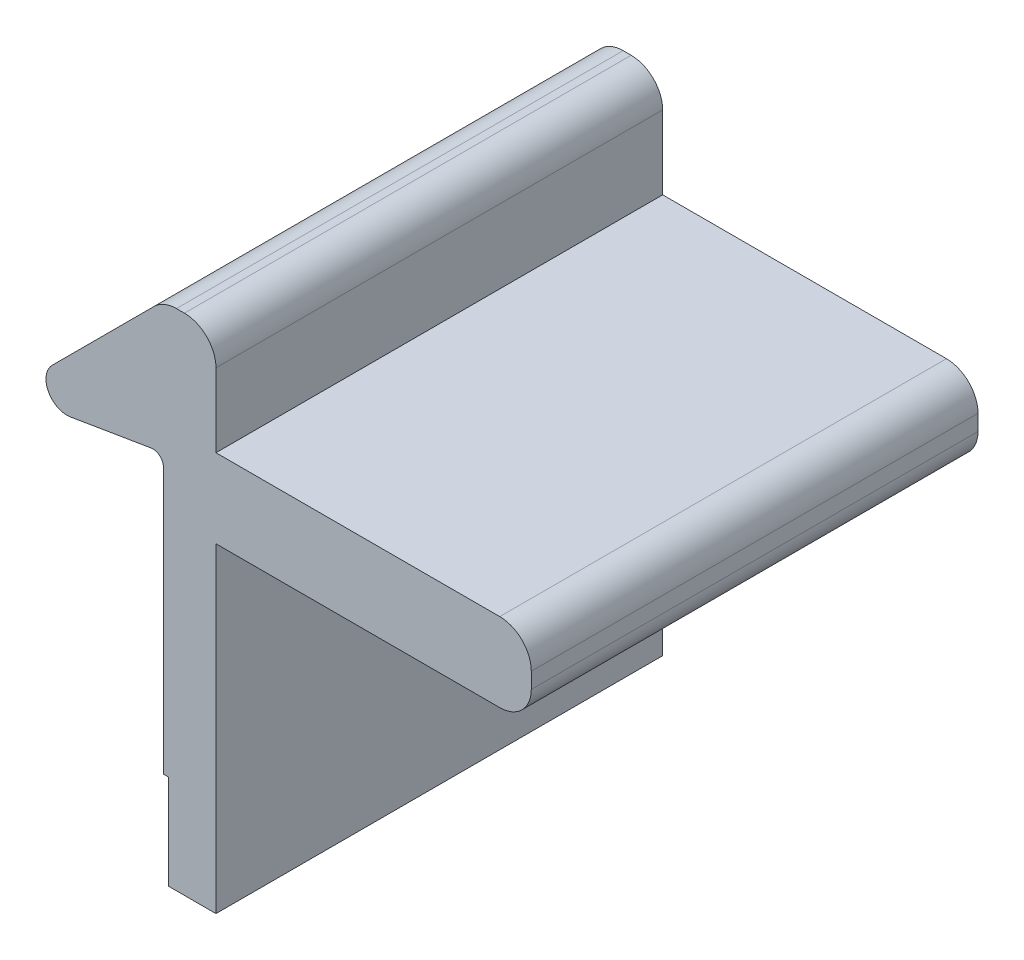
from build123d import *

# Parameters (mm, degrees)
EXTRUDE_1_DEPTH = 8.5
EXTRUDE_2_DEPTH = 0.6


with BuildPart() as part:
    # Sketch 1 → Extrude 1 (new body)
    with BuildSketch(Plane.XY):
        with BuildLine():
            Line((-2.768796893, 6.8), (-1.232879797, 7.055986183))
            ThreePointArc((-1.232879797, 7.055986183), (-1.070725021, 7.011311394), (-1, 6.858707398))
            Line((-1, 6.858707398), (-1, 1.8))
            Line((-1, 1.8), (-0.9, 1.8))
            Line((-0.9, 1.8), (-0.9, 0))
            Line((-0.9, 0), (0, 0))
            Line((0, 0), (0, 6.094799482))
            Line((0, 6.094799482), (5.4, 6.094799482))
            ThreePointArc((5.4, 6.094799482), (5.824264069, 6.270535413), (6, 6.694799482))
            Line((6, 6.694799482), (6, 6.994799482))
            ThreePointArc((6, 6.994799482), (5.824264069, 7.419063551), (5.4, 7.594799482))
            Line((5.4, 7.594799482), (0, 7.594799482))
            Line((0, 7.594799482), (0, 8.994799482))
            ThreePointArc((0, 8.994799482), (-0.175735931, 9.419063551), (-0.6, 9.594799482))
            Line((-0.6, 9.594799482), (-0.751471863, 9.594799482))
            ThreePointArc((-0.751471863, 9.594799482), (-0.878623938, 9.581171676), (-1, 9.540907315))
            ThreePointArc((-1, 9.540907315), (-1.093339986, 9.487877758), (-1.175735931, 9.419063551))
            Line((-1.175735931, 9.419063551), (-3.1173992, 7.477400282))
            ThreePointArc((-3.1173992, 7.477400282), (-3.190223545, 7.011524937), (-2.768796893, 6.8))
        make_face()
    extrude(amount=EXTRUDE_1_DEPTH)

    # Sketch 1_3 → Extrude 2 (add)
    with BuildSketch(Plane.XY):
        with BuildLine():
            ThreePointArc((-1, 6.858707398), (-1.070725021, 7.011311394), (-1.232879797, 7.055986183))
            Line((-1.232879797, 7.055986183), (-2.768796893, 6.8))
            ThreePointArc((-2.768796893, 6.8), (-2.976169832, 6.820464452), (-3.145110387, 6.94245387))
            Line((-3.145110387, 6.94245387), (-1, 4.3))
            Line((-1, 4.3), (-1, 6.858707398))
        make_face()
    extrude(amount=EXTRUDE_2_DEPTH)


solid = part.part
